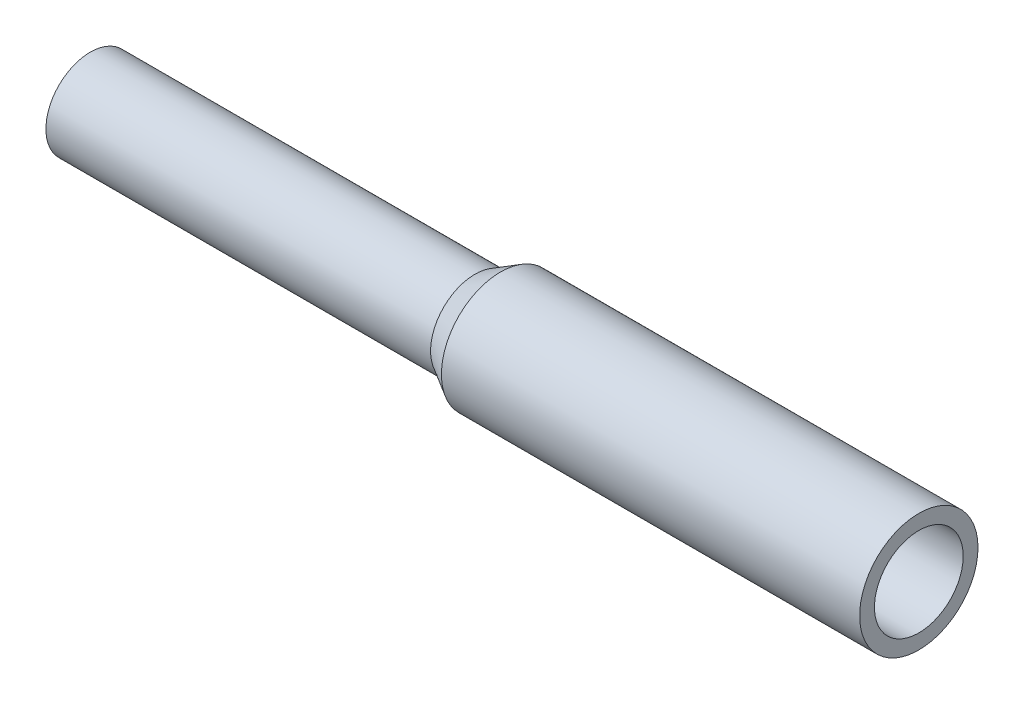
ISO-10303-21;
HEADER;
FILE_DESCRIPTION(('STEP AP214'),'2;1');
FILE_NAME('part.step','',(''),(''),'','','');
FILE_SCHEMA(('AUTOMOTIVE_DESIGN { 1 0 10303 214 1 1 1 1 }'));
ENDSEC;
DATA;
#1=APPLICATION_CONTEXT('core data for automotive mechanical design processes');
#2=APPLICATION_PROTOCOL_DEFINITION('international standard','automotive_design',2000,#1);
#3=PRODUCT_CONTEXT('',#1,'mechanical');
#4=PRODUCT('Part','Part','',(#3));
#5=PRODUCT_RELATED_PRODUCT_CATEGORY('part','',(#4));
#6=PRODUCT_DEFINITION_FORMATION('','',#4);
#7=PRODUCT_DEFINITION_CONTEXT('part definition',#1,'design');
#8=PRODUCT_DEFINITION('design','',#6,#7);
#9=PRODUCT_DEFINITION_SHAPE('','',#8);
#10=(LENGTH_UNIT() NAMED_UNIT(*) SI_UNIT(.MILLI.,.METRE.));
#11=(NAMED_UNIT(*) PLANE_ANGLE_UNIT() SI_UNIT($,.RADIAN.));
#12=(NAMED_UNIT(*) SI_UNIT($,.STERADIAN.) SOLID_ANGLE_UNIT());
#13=UNCERTAINTY_MEASURE_WITH_UNIT(LENGTH_MEASURE(1.E-05),#10,'distance_accuracy_value','');
#14=(GEOMETRIC_REPRESENTATION_CONTEXT(3) GLOBAL_UNCERTAINTY_ASSIGNED_CONTEXT((#13)) GLOBAL_UNIT_ASSIGNED_CONTEXT((#10,
#11,#12)) REPRESENTATION_CONTEXT('',''));
#15=CARTESIAN_POINT('',(0.,0.,0.));
#16=DIRECTION('',(0.,0.,1.));
#17=DIRECTION('',(1.,0.,0.));
#18=AXIS2_PLACEMENT_3D('',#15,#16,#17);
#19=CARTESIAN_POINT('',(0.,2.,0.));
#20=DIRECTION('',(1.,0.,0.));
#21=DIRECTION('',(0.,0.,-1.));
#22=AXIS2_PLACEMENT_3D('',#19,#20,#21);
#23=PLANE('',#22);
#24=CARTESIAN_POINT('',(0.,0.,0.));
#25=DIRECTION('',(1.,0.,0.));
#26=DIRECTION('',(0.,0.,-1.));
#27=AXIS2_PLACEMENT_3D('',#24,#25,#26);
#28=CIRCLE('',#27,2.);
#29=CARTESIAN_POINT('',(0.,0.,-2.));
#30=VERTEX_POINT('',#29);
#31=EDGE_CURVE('E63',#30,#30,#28,.T.);
#32=ORIENTED_EDGE('',*,*,#31,.T.);
#33=EDGE_LOOP('',(#32));
#34=FACE_BOUND('',#33,.T.);
#35=CARTESIAN_POINT('',(0.,0.,0.));
#36=DIRECTION('',(1.,0.,0.));
#37=DIRECTION('',(0.,0.,-1.));
#38=AXIS2_PLACEMENT_3D('',#35,#36,#37);
#39=CIRCLE('',#38,1.5);
#40=CARTESIAN_POINT('',(0.,0.,-1.5));
#41=VERTEX_POINT('',#40);
#42=EDGE_CURVE('E11',#41,#41,#39,.T.);
#43=ORIENTED_EDGE('',*,*,#42,.F.);
#44=EDGE_LOOP('',(#43));
#45=FACE_BOUND('',#44,.T.);
#46=ADVANCED_FACE('F32',(#34,#45),#23,.T.);
#47=CARTESIAN_POINT('',(0.,0.,0.));
#48=DIRECTION('',(1.,0.,0.));
#49=DIRECTION('',(0.,0.,-1.));
#50=AXIS2_PLACEMENT_3D('',#47,#48,#49);
#51=CYLINDRICAL_SURFACE('',#50,1.5);
#52=ORIENTED_EDGE('',*,*,#42,.T.);
#53=EDGE_LOOP('',(#52));
#54=FACE_BOUND('',#53,.T.);
#55=CARTESIAN_POINT('',(-12.,0.,0.));
#56=DIRECTION('',(1.,0.,0.));
#57=DIRECTION('',(0.,0.,-1.));
#58=AXIS2_PLACEMENT_3D('',#55,#56,#57);
#59=CIRCLE('',#58,1.5);
#60=CARTESIAN_POINT('',(-12.,0.,-1.5));
#61=VERTEX_POINT('',#60);
#62=EDGE_CURVE('E38',#61,#61,#59,.T.);
#63=ORIENTED_EDGE('',*,*,#62,.F.);
#64=EDGE_LOOP('',(#63));
#65=FACE_BOUND('',#64,.T.);
#66=ADVANCED_FACE('F44',(#54,#65),#51,.F.);
#67=CARTESIAN_POINT('',(-12.9012909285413,0.,0.));
#68=DIRECTION('',(1.,0.,0.));
#69=DIRECTION('',(0.,0.,-1.));
#70=AXIS2_PLACEMENT_3D('',#67,#68,#69);
#71=CONICAL_SURFACE('',#70,0.,1.02974425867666);
#72=ORIENTED_EDGE('',*,*,#62,.T.);
#73=EDGE_LOOP('',(#72));
#74=FACE_BOUND('',#73,.T.);
#75=CARTESIAN_POINT('',(-12.9012909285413,0.,0.));
#76=VERTEX_POINT('',#75);
#77=VERTEX_LOOP('',#76);
#78=FACE_BOUND('',#77,.T.);
#79=ADVANCED_FACE('F41',(#74,#78),#71,.F.);
#80=CARTESIAN_POINT('',(-28.,0.,0.));
#81=DIRECTION('',(-1.,0.,0.));
#82=DIRECTION('',(0.,0.,1.));
#83=AXIS2_PLACEMENT_3D('',#80,#81,#82);
#84=PLANE('',#83);
#85=CARTESIAN_POINT('',(-28.,0.,0.));
#86=DIRECTION('',(1.,0.,0.));
#87=DIRECTION('',(0.,0.,-1.));
#88=AXIS2_PLACEMENT_3D('',#85,#86,#87);
#89=CIRCLE('',#88,1.5);
#90=CARTESIAN_POINT('',(-28.,0.,-1.5));
#91=VERTEX_POINT('',#90);
#92=EDGE_CURVE('E67',#91,#91,#89,.T.);
#93=ORIENTED_EDGE('',*,*,#92,.F.);
#94=EDGE_LOOP('',(#93));
#95=FACE_BOUND('',#94,.T.);
#96=ADVANCED_FACE('F43',(#95),#84,.T.);
#97=CARTESIAN_POINT('',(0.,0.,0.));
#98=DIRECTION('',(1.,0.,0.));
#99=DIRECTION('',(0.,0.,-1.));
#100=AXIS2_PLACEMENT_3D('',#97,#98,#99);
#101=CYLINDRICAL_SURFACE('',#100,1.5);
#102=ORIENTED_EDGE('',*,*,#92,.T.);
#103=EDGE_LOOP('',(#102));
#104=FACE_BOUND('',#103,.T.);
#105=CARTESIAN_POINT('',(-15.,0.,0.));
#106=DIRECTION('',(1.,0.,0.));
#107=DIRECTION('',(0.,0.,-1.));
#108=AXIS2_PLACEMENT_3D('',#105,#106,#107);
#109=CIRCLE('',#108,1.5);
#110=CARTESIAN_POINT('',(-15.,0.,-1.5));
#111=VERTEX_POINT('',#110);
#112=EDGE_CURVE('E69',#111,#111,#109,.T.);
#113=ORIENTED_EDGE('',*,*,#112,.F.);
#114=EDGE_LOOP('',(#113));
#115=FACE_BOUND('',#114,.T.);
#116=ADVANCED_FACE('F51',(#104,#115),#101,.T.);
#117=CARTESIAN_POINT('',(-14.1339745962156,0.,0.));
#118=DIRECTION('',(1.,0.,0.));
#119=DIRECTION('',(0.,0.,-1.));
#120=AXIS2_PLACEMENT_3D('',#117,#118,#119);
#121=CONICAL_SURFACE('',#120,2.,0.5235987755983);
#122=ORIENTED_EDGE('',*,*,#112,.T.);
#123=EDGE_LOOP('',(#122));
#124=FACE_BOUND('',#123,.T.);
#125=CARTESIAN_POINT('',(-14.1339745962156,0.,0.));
#126=DIRECTION('',(1.,0.,0.));
#127=DIRECTION('',(0.,0.,-1.));
#128=AXIS2_PLACEMENT_3D('',#125,#126,#127);
#129=CIRCLE('',#128,2.);
#130=CARTESIAN_POINT('',(-14.1339745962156,0.,-2.));
#131=VERTEX_POINT('',#130);
#132=EDGE_CURVE('E74',#131,#131,#129,.T.);
#133=ORIENTED_EDGE('',*,*,#132,.F.);
#134=EDGE_LOOP('',(#133));
#135=FACE_BOUND('',#134,.T.);
#136=ADVANCED_FACE('F82',(#124,#135),#121,.T.);
#137=CARTESIAN_POINT('',(0.,0.,0.));
#138=DIRECTION('',(1.,0.,0.));
#139=DIRECTION('',(0.,0.,-1.));
#140=AXIS2_PLACEMENT_3D('',#137,#138,#139);
#141=CYLINDRICAL_SURFACE('',#140,2.);
#142=ORIENTED_EDGE('',*,*,#132,.T.);
#143=EDGE_LOOP('',(#142));
#144=FACE_BOUND('',#143,.T.);
#145=ORIENTED_EDGE('',*,*,#31,.F.);
#146=EDGE_LOOP('',(#145));
#147=FACE_BOUND('',#146,.T.);
#148=ADVANCED_FACE('F79',(#144,#147),#141,.T.);
#149=CLOSED_SHELL('',(#46,#66,#79,#96,#116,#136,#148));
#150=MANIFOLD_SOLID_BREP('B2',#149);
#151=ADVANCED_BREP_SHAPE_REPRESENTATION('',(#18,#150),#14);
#152=SHAPE_DEFINITION_REPRESENTATION(#9,#151);
ENDSEC;
END-ISO-10303-21;
